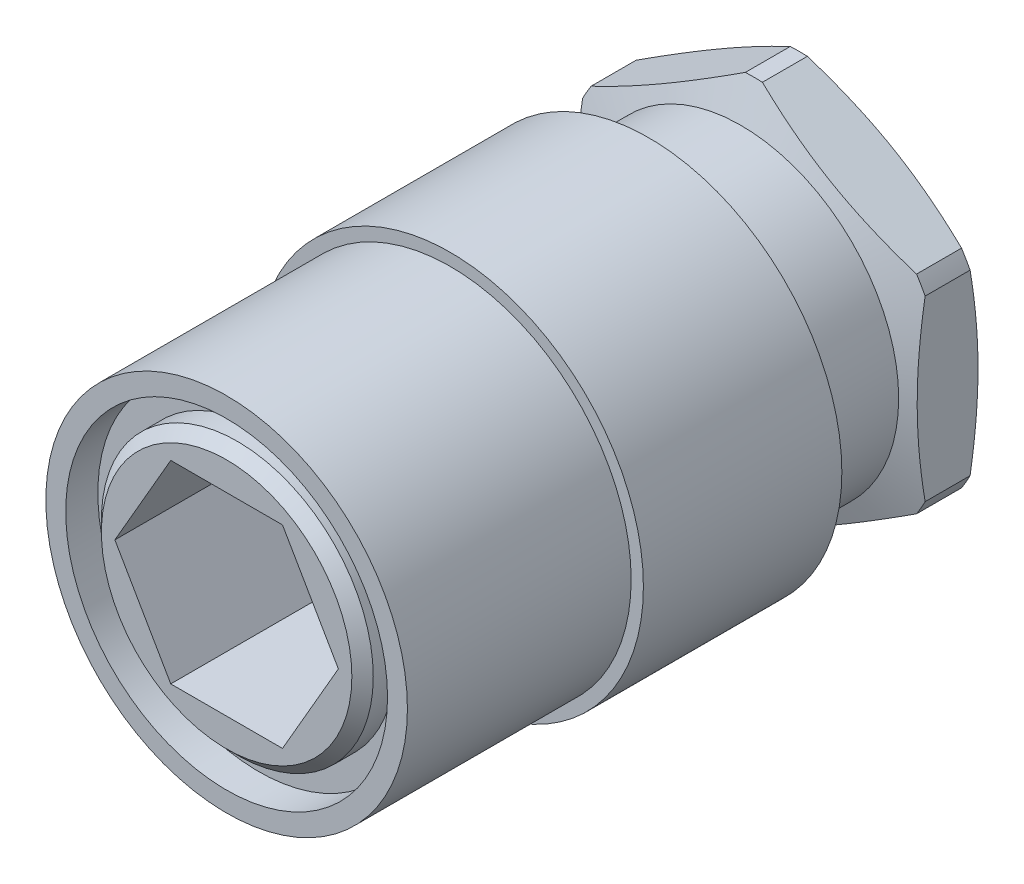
from build123d import *

# Parameters (mm, degrees)
SKETCH2_R           = 9.017
BOSS_EXTRUDE1_DEPTH = 27.3304
SKETCH5_OUTSIDE_W   = 27.51
SKETCH5_OUTSIDE_H   = 27.51
CUT_EXTRUDE1_DEPTH  = 3.302
SKETCH6_W           = 4.3053
SKETCH6_H           = 2.54
SKETCH11_R          = 7.517
SKETCH11_R_2        = 6.35
CUT_EXTRUDE3_DEPTH  = 1.5
SKETCH23_R          = 5.1435
CUT_EXTRUDE7_DEPTH  = 10
CUT_EXTRUDE7_DRAFT  = -3
SKETCH27_W          = 10.4521
SKETCH27_H          = 0.5715
CHAMFER5_SIZE       = 1
CHAMFER5_SIZE2      = 1.056754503
CHAMFER7_SIZE       = 0.5
CUT_EXTRUDE8_DEPTH  = 10.4521


with BuildPart() as part:
    # Sketch2 → Boss-Extrude1 (new body)
    with BuildSketch(Plane.XY):
        Circle(SKETCH2_R)
    extrude(amount=-BOSS_EXTRUDE1_DEPTH)

    # Sketch5 outside → Cut-Extrude1 (cut)
    with BuildSketch(Plane(origin=(0, 0, -27.3304), x_dir=(-1, 0, 0), z_dir=(0, 0, -1))):
        Rectangle(SKETCH5_OUTSIDE_W, SKETCH5_OUTSIDE_H)
        Polygon((-8.001, -4.619379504), (0, -9.238759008), (8.001, -4.619379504), (8.001, 4.619379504), (0, 9.238759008), (-8.001, 4.619379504), align=None, mode=Mode.SUBTRACT)
    extrude(amount=-CUT_EXTRUDE1_DEPTH, mode=Mode.SUBTRACT)

    # Sketch6 → Cut-Revolve1 (revolve, cut)
    with BuildSketch(Plane(origin=(0, 0, 0), x_dir=(0, 0, -1), z_dir=(1, 0, 0)), mode=Mode.PRIVATE) as cut_revolve1_sk:
        with Locations((21.87575, 8.636)):
            Rectangle(SKETCH6_W, SKETCH6_H)
    revolve(cut_revolve1_sk.sketch.rotate(Axis((0, 0, 0), (0, 0, -1)), 90), axis=Axis((0, 0, 0), (0, 0, -1)), mode=Mode.SUBTRACT)

    # Sketch11 → Cut-Extrude3 (cut)
    with BuildSketch(Plane.XY):
        Circle(SKETCH11_R)
        Circle(SKETCH11_R_2, mode=Mode.SUBTRACT)
    extrude(amount=-CUT_EXTRUDE3_DEPTH, mode=Mode.SUBTRACT)

    # Sketch12 → Cut-Revolve2 (revolve, cut)
    with BuildSketch(Plane(origin=(0, 0, 0), x_dir=(0, 0, -1), z_dir=(1, 0, 0)), mode=Mode.PRIVATE) as cut_revolve2_sk:
        Polygon((24.0284, 9.51614886), (24.0284, 7.366), (24.810990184, 9.51614886), align=None)
        Polygon((26.547809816, 9.51614886), (27.3304, 9.51614886), (27.3304, 7.366), align=None)
    revolve(cut_revolve2_sk.sketch.rotate(Axis((0, 0, 0), (0, 0, -1)), 242.538877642), axis=Axis((0, 0, 0), (0, 0, -1)), mode=Mode.SUBTRACT)


with BuildPart() as cut_extrude7_tool:
    # Sketch23 → Cut-Extrude7 (with draft: the straight prism first)
    with BuildSketch(Plane(origin=(0, 0, -27.3304), x_dir=(-1, 0, 0), z_dir=(0, 0, -1))):
        Circle(SKETCH23_R)
    extrude(amount=-CUT_EXTRUDE7_DEPTH)
    # Cut-Extrude7: the draft: its side faces are tilted about the plane it starts from
    cut_extrude7_sides = [cut_extrude7_tool.faces().sort_by_distance(p)[0] for p in [
        (5.1435, 0, -22.3304),
    ]]
    draft(cut_extrude7_sides, Plane(origin=(0, 0, -27.3304), x_dir=(-1, 0, 0), z_dir=(0, 0, -1)), CUT_EXTRUDE7_DRAFT)


with BuildPart() as part_1:
    add(part.part)

    # Cut-Extrude7: cut by cut_extrude7_tool
    add(cut_extrude7_tool.part, mode=Mode.SUBTRACT)

    # Sketch27 → Cut-Revolve5 (revolve, cut)
    with BuildSketch(Plane(origin=(0, 0, 0), x_dir=(0, 0, -1), z_dir=(1, 0, 0)), mode=Mode.PRIVATE) as cut_revolve5_sk:
        with Locations((5.22605, 8.73125)):
            Rectangle(SKETCH27_W, SKETCH27_H)
    revolve(cut_revolve5_sk.sketch.rotate(Axis((0, 0, 0), (0, 0, -1)), 90), axis=Axis((0, 0, 0), (0, 0, -1)), mode=Mode.SUBTRACT)

    # Chamfer5
    chamfer5_edges = [part_1.edges().sort_by_distance(p)[0] for p in [
        (5.1435, 0, -27.3304),
    ]]
    chamfer5_side = [part_1.faces().sort_by_distance(p)[0] for p in [
        (6.351161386, 3.300729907, -27.3304),
    ]]
    chamfer(chamfer5_edges, length=CHAMFER5_SIZE, length2=CHAMFER5_SIZE2, reference=chamfer5_side[0])

    # Chamfer7
    chamfer7_edges = [part_1.edges().sort_by_distance(p)[0] for p in [
        (-6.35, 0, 0),
    ]]
    chamfer(chamfer7_edges, length=CHAMFER7_SIZE)

    # Sketch29 → Cut-Revolve6 (revolve, cut)
    with BuildSketch(Plane(origin=(0, 0, 0), x_dir=(0, 0, -1), z_dir=(1, 0, 0)), mode=Mode.PRIVATE) as cut_revolve6_sk:
        Polygon((0, 0), (29.163487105, 0), (27.3304, 3.175), (10.4521, 3.175), (10.4521, 4.445), (0, 4.445), align=None)
    revolve(cut_revolve6_sk.sketch.rotate(Axis((0, 0, 3.947771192), (0, 0, -1)), 90), axis=Axis((0, 0, 3.947771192), (0, 0, -1)), mode=Mode.SUBTRACT)

    # Sketch30 → Cut-Extrude8 (cut)
    with BuildSketch(Plane.XY):
        Polygon((-2.610316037, 4.5212), (-5.220632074, 0), (-2.610316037, -4.5212), (2.610316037, -4.5212), (5.220632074, 0), (2.610316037, 4.5212), align=None)
    extrude(amount=-CUT_EXTRUDE8_DEPTH, mode=Mode.SUBTRACT)


solid = part_1.part
